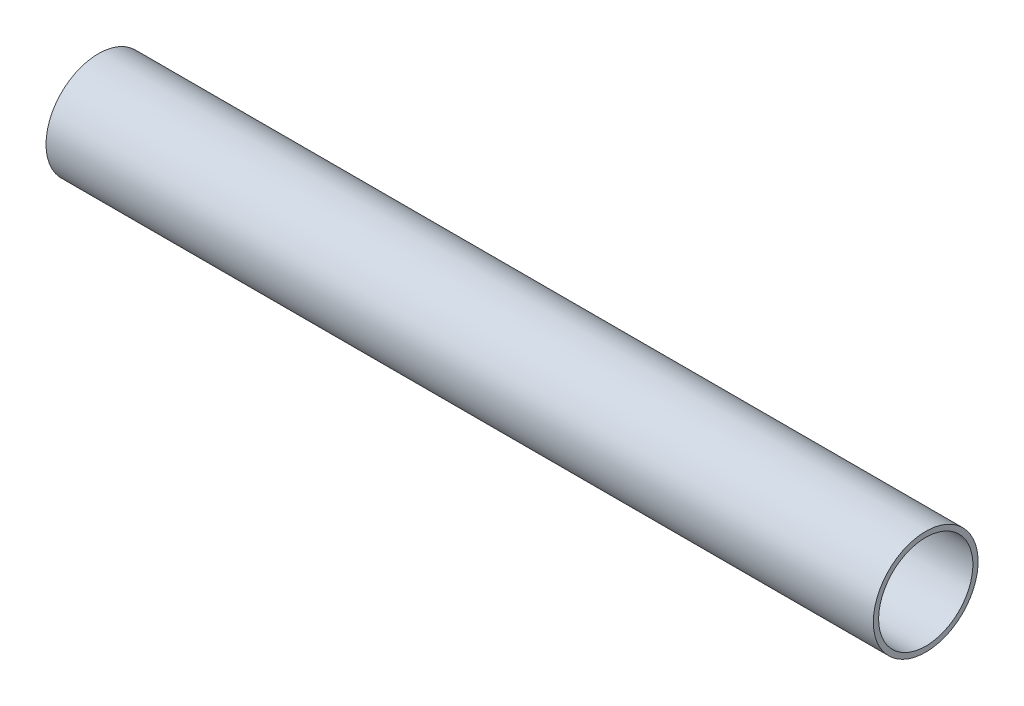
from build123d import *

# Parameters (mm, degrees)
SKIZZE1_W = 1580
SKIZZE1_H = 10


with BuildPart() as part:
    # Skizze1 → Rotation1 (revolve)
    with BuildSketch(Plane.XY, mode=Mode.PRIVATE) as rotation1_sk:
        with Locations((790, 95)):
            Rectangle(SKIZZE1_W, SKIZZE1_H)
    revolve(rotation1_sk.sketch.rotate(Axis((0, 0, 0), (1, 0, 0)), 90), axis=Axis((0, 0, 0), (1, 0, 0)))


solid = part.part
